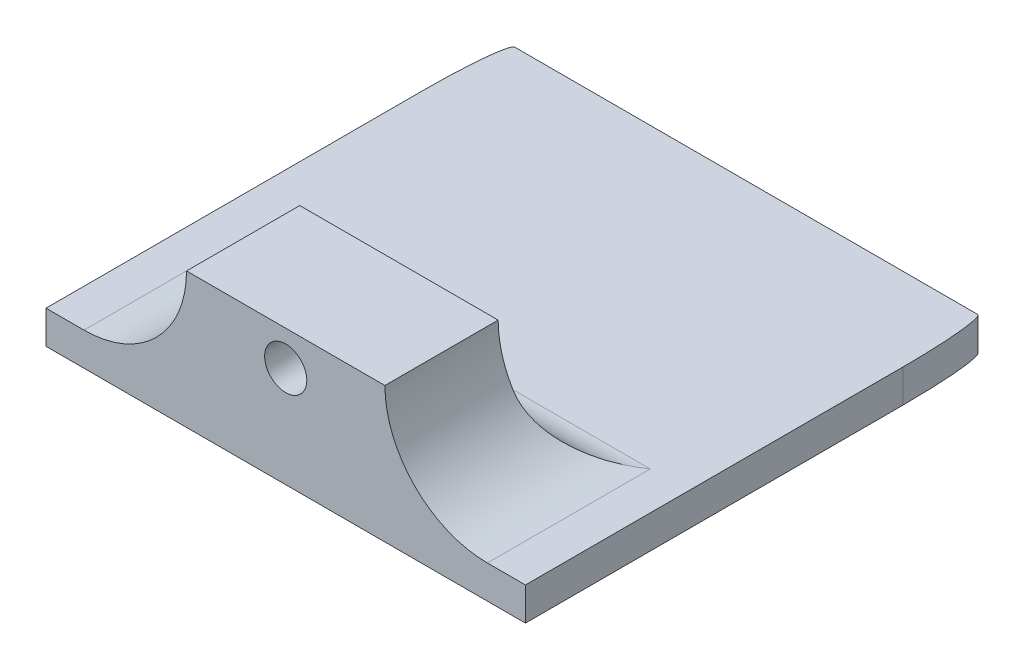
ISO-10303-21;
HEADER;
FILE_DESCRIPTION(('STEP AP214'),'2;1');
FILE_NAME('part.step','',(''),(''),'','','');
FILE_SCHEMA(('AUTOMOTIVE_DESIGN { 1 0 10303 214 1 1 1 1 }'));
ENDSEC;
DATA;
#1=APPLICATION_CONTEXT('core data for automotive mechanical design processes');
#2=APPLICATION_PROTOCOL_DEFINITION('international standard','automotive_design',2000,#1);
#3=PRODUCT_CONTEXT('',#1,'mechanical');
#4=PRODUCT('Part','Part','',(#3));
#5=PRODUCT_RELATED_PRODUCT_CATEGORY('part','',(#4));
#6=PRODUCT_DEFINITION_FORMATION('','',#4);
#7=PRODUCT_DEFINITION_CONTEXT('part definition',#1,'design');
#8=PRODUCT_DEFINITION('design','',#6,#7);
#9=PRODUCT_DEFINITION_SHAPE('','',#8);
#10=(LENGTH_UNIT() NAMED_UNIT(*) SI_UNIT(.MILLI.,.METRE.));
#11=(NAMED_UNIT(*) PLANE_ANGLE_UNIT() SI_UNIT($,.RADIAN.));
#12=(NAMED_UNIT(*) SI_UNIT($,.STERADIAN.) SOLID_ANGLE_UNIT());
#13=UNCERTAINTY_MEASURE_WITH_UNIT(LENGTH_MEASURE(1.E-05),#10,'distance_accuracy_value','');
#14=(GEOMETRIC_REPRESENTATION_CONTEXT(3) GLOBAL_UNCERTAINTY_ASSIGNED_CONTEXT((#13)) GLOBAL_UNIT_ASSIGNED_CONTEXT((#10,
#11,#12)) REPRESENTATION_CONTEXT('',''));
#15=CARTESIAN_POINT('',(0.,0.,0.));
#16=DIRECTION('',(0.,0.,1.));
#17=DIRECTION('',(1.,0.,0.));
#18=AXIS2_PLACEMENT_3D('',#15,#16,#17);
#19=CARTESIAN_POINT('',(0.,0.,-13.7));
#20=DIRECTION('',(0.,0.,1.));
#21=DIRECTION('',(1.,0.,0.));
#22=AXIS2_PLACEMENT_3D('',#19,#20,#21);
#23=PLANE('',#22);
#24=DIRECTION('',(1.,0.,0.));
#25=VECTOR('',#24,1.);
#26=CARTESIAN_POINT('',(-29.,-2.2,-13.7));
#27=LINE('',#26,#25);
#28=CARTESIAN_POINT('',(13.7792655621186,-2.2,-13.7));
#29=VERTEX_POINT('',#28);
#30=CARTESIAN_POINT('',(-13.7792655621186,-2.20000000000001,-13.7));
#31=VERTEX_POINT('',#30);
#32=EDGE_CURVE('E12',#29,#31,#27,.F.);
#33=ORIENTED_EDGE('',*,*,#32,.T.);
#34=CARTESIAN_POINT('',(-24.4,4.2,-13.7));
#35=DIRECTION('',(0.,0.,1.));
#36=DIRECTION('',(1.,0.,0.));
#37=AXIS2_PLACEMENT_3D('',#34,#35,#36);
#38=CIRCLE('',#37,12.4);
#39=CARTESIAN_POINT('',(-12.,4.2,-13.7));
#40=VERTEX_POINT('',#39);
#41=EDGE_CURVE('E126',#40,#31,#38,.F.);
#42=ORIENTED_EDGE('',*,*,#41,.F.);
#43=DIRECTION('',(1.,0.,0.));
#44=VECTOR('',#43,1.);
#45=CARTESIAN_POINT('',(29.,4.2,-13.7));
#46=LINE('',#45,#44);
#47=CARTESIAN_POINT('',(12.,4.2,-13.7));
#48=VERTEX_POINT('',#47);
#49=EDGE_CURVE('E139',#40,#48,#46,.T.);
#50=ORIENTED_EDGE('',*,*,#49,.T.);
#51=CARTESIAN_POINT('',(24.4,4.2,-13.7));
#52=DIRECTION('',(0.,0.,1.));
#53=DIRECTION('',(1.,0.,0.));
#54=AXIS2_PLACEMENT_3D('',#51,#52,#53);
#55=CIRCLE('',#54,12.4);
#56=EDGE_CURVE('E413',#29,#48,#55,.F.);
#57=ORIENTED_EDGE('',*,*,#56,.F.);
#58=EDGE_LOOP('',(#33,#42,#50,#57));
#59=FACE_BOUND('',#58,.T.);
#60=ADVANCED_FACE('F43',(#59),#23,.F.);
#61=CARTESIAN_POINT('',(-29.,-12.2,-12.2));
#62=DIRECTION('',(-1.,0.,0.));
#63=DIRECTION('',(0.,0.,1.));
#64=AXIS2_PLACEMENT_3D('',#61,#62,#63);
#65=PLANE('',#64);
#66=DIRECTION('',(0.,-1.,0.));
#67=VECTOR('',#66,1.);
#68=CARTESIAN_POINT('',(-29.,-12.2,0.));
#69=LINE('',#68,#67);
#70=CARTESIAN_POINT('',(-29.,-8.2,0.));
#71=VERTEX_POINT('',#70);
#72=CARTESIAN_POINT('',(-29.,-12.2,0.));
#73=VERTEX_POINT('',#72);
#74=EDGE_CURVE('E159',#71,#73,#69,.T.);
#75=ORIENTED_EDGE('',*,*,#74,.F.);
#76=DIRECTION('',(0.,0.,1.));
#77=VECTOR('',#76,1.);
#78=CARTESIAN_POINT('',(-29.,-8.2,-55.7));
#79=LINE('',#78,#77);
#80=CARTESIAN_POINT('',(-29.,-8.2,-45.7));
#81=VERTEX_POINT('',#80);
#82=EDGE_CURVE('E147',#81,#71,#79,.T.);
#83=ORIENTED_EDGE('',*,*,#82,.F.);
#84=CARTESIAN_POINT('',(-29.,-12.4,-45.7));
#85=CARTESIAN_POINT('',(-29.,-10.9333333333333,-45.7));
#86=CARTESIAN_POINT('',(-29.,-9.46666666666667,-45.7));
#87=CARTESIAN_POINT('',(-29.,-8.,-45.7));
#88=(BOUNDED_CURVE() B_SPLINE_CURVE(3,(#84,#85,#86,#87),.UNSPECIFIED.,.F.,
.F.) B_SPLINE_CURVE_WITH_KNOTS((4,4),(0.008,0.0124),
.UNSPECIFIED.) CURVE() GEOMETRIC_REPRESENTATION_ITEM() RATIONAL_B_SPLINE_CURVE((1.,1.,1.,1.)) REPRESENTATION_ITEM(''));
#89=CARTESIAN_POINT('',(-29.,-12.2,-45.7));
#90=VERTEX_POINT('',#89);
#91=EDGE_CURVE('E315',#81,#90,#88,.F.);
#92=ORIENTED_EDGE('',*,*,#91,.T.);
#93=DIRECTION('',(0.,0.,1.));
#94=VECTOR('',#93,1.);
#95=CARTESIAN_POINT('',(-29.,-12.2,-12.2));
#96=LINE('',#95,#94);
#97=EDGE_CURVE('E170',#90,#73,#96,.T.);
#98=ORIENTED_EDGE('',*,*,#97,.T.);
#99=EDGE_LOOP('',(#75,#83,#92,#98));
#100=FACE_BOUND('',#99,.T.);
#101=ADVANCED_FACE('F208',(#100),#65,.T.);
#102=CARTESIAN_POINT('',(-29.,4.2,-12.2));
#103=DIRECTION('',(0.,1.,0.));
#104=DIRECTION('',(0.,0.,1.));
#105=AXIS2_PLACEMENT_3D('',#102,#103,#104);
#106=PLANE('',#105);
#107=DIRECTION('',(0.,0.,1.));
#108=VECTOR('',#107,1.);
#109=CARTESIAN_POINT('',(-12.,4.2,-55.751));
#110=LINE('',#109,#108);
#111=CARTESIAN_POINT('',(-12.,4.2,0.));
#112=VERTEX_POINT('',#111);
#113=EDGE_CURVE('E123',#40,#112,#110,.T.);
#114=ORIENTED_EDGE('',*,*,#113,.T.);
#115=DIRECTION('',(-1.,0.,0.));
#116=VECTOR('',#115,1.);
#117=CARTESIAN_POINT('',(-29.,4.2,0.));
#118=LINE('',#117,#116);
#119=CARTESIAN_POINT('',(12.,4.2,0.));
#120=VERTEX_POINT('',#119);
#121=EDGE_CURVE('E168',#120,#112,#118,.T.);
#122=ORIENTED_EDGE('',*,*,#121,.F.);
#123=DIRECTION('',(0.,0.,1.));
#124=VECTOR('',#123,1.);
#125=CARTESIAN_POINT('',(12.,4.2,-55.751));
#126=LINE('',#125,#124);
#127=EDGE_CURVE('E145',#48,#120,#126,.T.);
#128=ORIENTED_EDGE('',*,*,#127,.F.);
#129=ORIENTED_EDGE('',*,*,#49,.F.);
#130=EDGE_LOOP('',(#114,#122,#128,#129));
#131=FACE_BOUND('',#130,.T.);
#132=ADVANCED_FACE('F144',(#131),#106,.T.);
#133=CARTESIAN_POINT('',(29.,-12.2,-12.2));
#134=DIRECTION('',(1.,0.,0.));
#135=DIRECTION('',(0.,0.,-1.));
#136=AXIS2_PLACEMENT_3D('',#133,#134,#135);
#137=PLANE('',#136);
#138=DIRECTION('',(0.,0.,1.));
#139=VECTOR('',#138,1.);
#140=CARTESIAN_POINT('',(29.,-8.2,-55.7));
#141=LINE('',#140,#139);
#142=CARTESIAN_POINT('',(29.,-8.2,-45.7));
#143=VERTEX_POINT('',#142);
#144=CARTESIAN_POINT('',(29.,-8.2,0.));
#145=VERTEX_POINT('',#144);
#146=EDGE_CURVE('E152',#143,#145,#141,.T.);
#147=ORIENTED_EDGE('',*,*,#146,.T.);
#148=DIRECTION('',(0.,1.,0.));
#149=VECTOR('',#148,1.);
#150=CARTESIAN_POINT('',(29.,-12.2,0.));
#151=LINE('',#150,#149);
#152=CARTESIAN_POINT('',(29.,-12.2,0.));
#153=VERTEX_POINT('',#152);
#154=EDGE_CURVE('E165',#153,#145,#151,.T.);
#155=ORIENTED_EDGE('',*,*,#154,.F.);
#156=DIRECTION('',(0.,0.,1.));
#157=VECTOR('',#156,1.);
#158=CARTESIAN_POINT('',(29.,-12.2,-12.2));
#159=LINE('',#158,#157);
#160=CARTESIAN_POINT('',(29.,-12.2,-45.7));
#161=VERTEX_POINT('',#160);
#162=EDGE_CURVE('E176',#161,#153,#159,.T.);
#163=ORIENTED_EDGE('',*,*,#162,.F.);
#164=CARTESIAN_POINT('',(29.,-8.,-45.7));
#165=CARTESIAN_POINT('',(29.,-9.46666666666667,-45.7));
#166=CARTESIAN_POINT('',(29.,-10.9333333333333,-45.7));
#167=CARTESIAN_POINT('',(29.,-12.4,-45.7));
#168=(BOUNDED_CURVE() B_SPLINE_CURVE(3,(#164,#165,#166,#167),.UNSPECIFIED.,.F.,
.F.) B_SPLINE_CURVE_WITH_KNOTS((4,4),(-0.0124,-0.008),
.UNSPECIFIED.) CURVE() GEOMETRIC_REPRESENTATION_ITEM() RATIONAL_B_SPLINE_CURVE((1.,1.,1.,1.)) REPRESENTATION_ITEM(''));
#169=EDGE_CURVE('E330',#161,#143,#168,.F.);
#170=ORIENTED_EDGE('',*,*,#169,.T.);
#171=EDGE_LOOP('',(#147,#155,#163,#170));
#172=FACE_BOUND('',#171,.T.);
#173=ADVANCED_FACE('F205',(#172),#137,.T.);
#174=CARTESIAN_POINT('',(-29.,-12.2,-12.2));
#175=DIRECTION('',(0.,-1.,0.));
#176=DIRECTION('',(0.,0.,-1.));
#177=AXIS2_PLACEMENT_3D('',#174,#175,#176);
#178=PLANE('',#177);
#179=ORIENTED_EDGE('',*,*,#97,.F.);
#180=CARTESIAN_POINT('',(-28.,-12.2,-55.7));
#181=CARTESIAN_POINT('',(-29.,-12.2,-55.7));
#182=CARTESIAN_POINT('',(-29.,-12.2,-45.7));
#183=(BOUNDED_CURVE() B_SPLINE_CURVE(2,(#180,#181,#182),.UNSPECIFIED.,.F.,
.F.) B_SPLINE_CURVE_WITH_KNOTS((3,3),(0.,1.),
.UNSPECIFIED.) CURVE() GEOMETRIC_REPRESENTATION_ITEM() RATIONAL_B_SPLINE_CURVE((1.,
0.707106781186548,1.)) REPRESENTATION_ITEM(''));
#184=CARTESIAN_POINT('',(-28.,-12.2,-55.7));
#185=VERTEX_POINT('',#184);
#186=EDGE_CURVE('E312',#90,#185,#183,.F.);
#187=ORIENTED_EDGE('',*,*,#186,.T.);
#188=DIRECTION('',(-1.,0.,0.));
#189=VECTOR('',#188,1.);
#190=CARTESIAN_POINT('',(29.,-12.2,-55.7));
#191=LINE('',#190,#189);
#192=CARTESIAN_POINT('',(28.,-12.2,-55.7));
#193=VERTEX_POINT('',#192);
#194=EDGE_CURVE('E339',#193,#185,#191,.T.);
#195=ORIENTED_EDGE('',*,*,#194,.F.);
#196=CARTESIAN_POINT('',(29.,-12.2,-45.7));
#197=CARTESIAN_POINT('',(29.,-12.2,-55.7));
#198=CARTESIAN_POINT('',(28.,-12.2,-55.7));
#199=(BOUNDED_CURVE() B_SPLINE_CURVE(2,(#196,#197,#198),.UNSPECIFIED.,.F.,
.F.) B_SPLINE_CURVE_WITH_KNOTS((3,3),(0.,1.),
.UNSPECIFIED.) CURVE() GEOMETRIC_REPRESENTATION_ITEM() RATIONAL_B_SPLINE_CURVE((1.,
0.707106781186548,1.)) REPRESENTATION_ITEM(''));
#200=EDGE_CURVE('E187',#193,#161,#199,.F.);
#201=ORIENTED_EDGE('',*,*,#200,.T.);
#202=ORIENTED_EDGE('',*,*,#162,.T.);
#203=DIRECTION('',(1.,0.,0.));
#204=VECTOR('',#203,1.);
#205=CARTESIAN_POINT('',(-29.,-12.2,0.));
#206=LINE('',#205,#204);
#207=EDGE_CURVE('E162',#73,#153,#206,.T.);
#208=ORIENTED_EDGE('',*,*,#207,.F.);
#209=EDGE_LOOP('',(#179,#187,#195,#201,#202,#208));
#210=FACE_BOUND('',#209,.T.);
#211=ADVANCED_FACE('F194',(#210),#178,.T.);
#212=CARTESIAN_POINT('',(0.,0.,0.));
#213=DIRECTION('',(0.,0.,-1.));
#214=DIRECTION('',(-1.,0.,0.));
#215=AXIS2_PLACEMENT_3D('',#212,#213,#214);
#216=PLANE('',#215);
#217=CARTESIAN_POINT('',(0.,0.,0.));
#218=DIRECTION('',(0.,0.,1.));
#219=DIRECTION('',(1.,0.,0.));
#220=AXIS2_PLACEMENT_3D('',#217,#218,#219);
#221=CIRCLE('',#220,2.55);
#222=CARTESIAN_POINT('',(2.55,0.,0.));
#223=VERTEX_POINT('',#222);
#224=EDGE_CURVE('E146',#223,#223,#221,.T.);
#225=ORIENTED_EDGE('',*,*,#224,.F.);
#226=EDGE_LOOP('',(#225));
#227=FACE_BOUND('',#226,.T.);
#228=ORIENTED_EDGE('',*,*,#121,.T.);
#229=CARTESIAN_POINT('',(-24.4,4.2,0.));
#230=DIRECTION('',(0.,0.,1.));
#231=DIRECTION('',(-1.,0.,0.));
#232=AXIS2_PLACEMENT_3D('',#229,#230,#231);
#233=CIRCLE('',#232,12.4);
#234=CARTESIAN_POINT('',(-24.4,-8.2,0.));
#235=VERTEX_POINT('',#234);
#236=EDGE_CURVE('E128',#235,#112,#233,.T.);
#237=ORIENTED_EDGE('',*,*,#236,.F.);
#238=DIRECTION('',(1.,0.,0.));
#239=VECTOR('',#238,1.);
#240=CARTESIAN_POINT('',(-24.4,-8.2,0.));
#241=LINE('',#240,#239);
#242=EDGE_CURVE('E134',#71,#235,#241,.T.);
#243=ORIENTED_EDGE('',*,*,#242,.F.);
#244=ORIENTED_EDGE('',*,*,#74,.T.);
#245=ORIENTED_EDGE('',*,*,#207,.T.);
#246=ORIENTED_EDGE('',*,*,#154,.T.);
#247=DIRECTION('',(1.,0.,0.));
#248=VECTOR('',#247,1.);
#249=CARTESIAN_POINT('',(24.4,-8.2,0.));
#250=LINE('',#249,#248);
#251=CARTESIAN_POINT('',(24.4,-8.2,0.));
#252=VERTEX_POINT('',#251);
#253=EDGE_CURVE('E417',#252,#145,#250,.T.);
#254=ORIENTED_EDGE('',*,*,#253,.F.);
#255=CARTESIAN_POINT('',(24.4,4.2,0.));
#256=DIRECTION('',(0.,0.,1.));
#257=DIRECTION('',(1.,0.,0.));
#258=AXIS2_PLACEMENT_3D('',#255,#256,#257);
#259=CIRCLE('',#258,12.4);
#260=EDGE_CURVE('E415',#120,#252,#259,.T.);
#261=ORIENTED_EDGE('',*,*,#260,.F.);
#262=EDGE_LOOP('',(#228,#237,#243,#244,#245,#246,#254,#261));
#263=FACE_BOUND('',#262,.T.);
#264=ADVANCED_FACE('F204',(#227,#263),#216,.F.);
#265=CARTESIAN_POINT('',(0.,0.,-12.2));
#266=DIRECTION('',(0.,0.,1.));
#267=DIRECTION('',(1.,0.,0.));
#268=AXIS2_PLACEMENT_3D('',#265,#266,#267);
#269=CYLINDRICAL_SURFACE('',#268,2.55);
#270=CARTESIAN_POINT('',(0.,0.,-12.2));
#271=DIRECTION('',(0.,0.,1.));
#272=DIRECTION('',(1.,0.,0.));
#273=AXIS2_PLACEMENT_3D('',#270,#271,#272);
#274=CIRCLE('',#273,2.55);
#275=CARTESIAN_POINT('',(2.55,0.,-12.2));
#276=VERTEX_POINT('',#275);
#277=EDGE_CURVE('E150',#276,#276,#274,.T.);
#278=ORIENTED_EDGE('',*,*,#277,.F.);
#279=EDGE_LOOP('',(#278));
#280=FACE_BOUND('',#279,.T.);
#281=ORIENTED_EDGE('',*,*,#224,.T.);
#282=EDGE_LOOP('',(#281));
#283=FACE_BOUND('',#282,.T.);
#284=ADVANCED_FACE('F462',(#280,#283),#269,.F.);
#285=CARTESIAN_POINT('',(0.,0.,-12.2));
#286=DIRECTION('',(0.,0.,1.));
#287=DIRECTION('',(1.,0.,0.));
#288=AXIS2_PLACEMENT_3D('',#285,#286,#287);
#289=PLANE('',#288);
#290=ORIENTED_EDGE('',*,*,#277,.T.);
#291=EDGE_LOOP('',(#290));
#292=FACE_BOUND('',#291,.T.);
#293=ADVANCED_FACE('F379',(#292),#289,.T.);
#294=CARTESIAN_POINT('',(29.,-8.2,-55.7));
#295=DIRECTION('',(0.,-1.,0.));
#296=DIRECTION('',(0.,0.,-1.));
#297=AXIS2_PLACEMENT_3D('',#294,#295,#296);
#298=PLANE('',#297);
#299=ORIENTED_EDGE('',*,*,#82,.T.);
#300=ORIENTED_EDGE('',*,*,#242,.T.);
#301=DIRECTION('',(0.,0.,1.));
#302=VECTOR('',#301,1.);
#303=CARTESIAN_POINT('',(-24.4,-8.2,-55.751));
#304=LINE('',#303,#302);
#305=CARTESIAN_POINT('',(-24.4,-8.2,-19.7));
#306=VERTEX_POINT('',#305);
#307=EDGE_CURVE('E133',#306,#235,#304,.T.);
#308=ORIENTED_EDGE('',*,*,#307,.F.);
#309=DIRECTION('',(1.,0.,0.));
#310=VECTOR('',#309,1.);
#311=CARTESIAN_POINT('',(29.,-8.2,-19.7));
#312=LINE('',#311,#310);
#313=CARTESIAN_POINT('',(24.4,-8.2,-19.7));
#314=VERTEX_POINT('',#313);
#315=EDGE_CURVE('E50',#306,#314,#312,.T.);
#316=ORIENTED_EDGE('',*,*,#315,.T.);
#317=DIRECTION('',(0.,0.,1.));
#318=VECTOR('',#317,1.);
#319=CARTESIAN_POINT('',(24.4,-8.2,-55.751));
#320=LINE('',#319,#318);
#321=EDGE_CURVE('E57',#314,#252,#320,.T.);
#322=ORIENTED_EDGE('',*,*,#321,.T.);
#323=ORIENTED_EDGE('',*,*,#253,.T.);
#324=ORIENTED_EDGE('',*,*,#146,.F.);
#325=CARTESIAN_POINT('',(28.,-8.2,-55.7));
#326=CARTESIAN_POINT('',(29.,-8.2,-55.7));
#327=CARTESIAN_POINT('',(29.,-8.2,-45.7));
#328=(BOUNDED_CURVE() B_SPLINE_CURVE(2,(#325,#326,#327),.UNSPECIFIED.,.F.,
.F.) B_SPLINE_CURVE_WITH_KNOTS((3,3),(0.,1.),
.UNSPECIFIED.) CURVE() GEOMETRIC_REPRESENTATION_ITEM() RATIONAL_B_SPLINE_CURVE((1.,
0.707106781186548,1.)) REPRESENTATION_ITEM(''));
#329=CARTESIAN_POINT('',(28.,-8.2,-55.7));
#330=VERTEX_POINT('',#329);
#331=EDGE_CURVE('E326',#143,#330,#328,.F.);
#332=ORIENTED_EDGE('',*,*,#331,.T.);
#333=DIRECTION('',(1.,0.,0.));
#334=VECTOR('',#333,1.);
#335=CARTESIAN_POINT('',(29.,-8.2,-55.7));
#336=LINE('',#335,#334);
#337=CARTESIAN_POINT('',(-28.,-8.2,-55.7));
#338=VERTEX_POINT('',#337);
#339=EDGE_CURVE('E340',#338,#330,#336,.T.);
#340=ORIENTED_EDGE('',*,*,#339,.F.);
#341=CARTESIAN_POINT('',(-29.,-8.2,-45.7));
#342=CARTESIAN_POINT('',(-29.,-8.2,-55.7));
#343=CARTESIAN_POINT('',(-28.,-8.2,-55.7));
#344=(BOUNDED_CURVE() B_SPLINE_CURVE(2,(#341,#342,#343),.UNSPECIFIED.,.F.,
.F.) B_SPLINE_CURVE_WITH_KNOTS((3,3),(0.,1.),
.UNSPECIFIED.) CURVE() GEOMETRIC_REPRESENTATION_ITEM() RATIONAL_B_SPLINE_CURVE((1.,
0.707106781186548,1.)) REPRESENTATION_ITEM(''));
#345=EDGE_CURVE('E227',#338,#81,#344,.F.);
#346=ORIENTED_EDGE('',*,*,#345,.T.);
#347=EDGE_LOOP('',(#299,#300,#308,#316,#322,#323,#324,#332,#340,#346));
#348=FACE_BOUND('',#347,.T.);
#349=ADVANCED_FACE('F372',(#348),#298,.F.);
#350=CARTESIAN_POINT('',(0.,0.,-55.7));
#351=DIRECTION('',(0.,0.,1.));
#352=DIRECTION('',(1.,0.,0.));
#353=AXIS2_PLACEMENT_3D('',#350,#351,#352);
#354=PLANE('',#353);
#355=ORIENTED_EDGE('',*,*,#194,.T.);
#356=CARTESIAN_POINT('',(-28.,-8.,-55.7));
#357=CARTESIAN_POINT('',(-28.,-9.46666666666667,-55.7));
#358=CARTESIAN_POINT('',(-28.,-10.9333333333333,-55.7));
#359=CARTESIAN_POINT('',(-28.,-12.4,-55.7));
#360=(BOUNDED_CURVE() B_SPLINE_CURVE(3,(#356,#357,#358,#359),.UNSPECIFIED.,.F.,
.F.) B_SPLINE_CURVE_WITH_KNOTS((4,4),(0.008,0.0124),
.UNSPECIFIED.) CURVE() GEOMETRIC_REPRESENTATION_ITEM() RATIONAL_B_SPLINE_CURVE((1.,1.,1.,1.)) REPRESENTATION_ITEM(''));
#361=EDGE_CURVE('E323',#185,#338,#360,.F.);
#362=ORIENTED_EDGE('',*,*,#361,.T.);
#363=ORIENTED_EDGE('',*,*,#339,.T.);
#364=CARTESIAN_POINT('',(28.,-12.4,-55.7));
#365=CARTESIAN_POINT('',(28.,-10.9333333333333,-55.7));
#366=CARTESIAN_POINT('',(28.,-9.46666666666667,-55.7));
#367=CARTESIAN_POINT('',(28.,-8.,-55.7));
#368=(BOUNDED_CURVE() B_SPLINE_CURVE(3,(#364,#365,#366,#367),.UNSPECIFIED.,.F.,
.F.) B_SPLINE_CURVE_WITH_KNOTS((4,4),(-0.0124,-0.008),
.UNSPECIFIED.) CURVE() GEOMETRIC_REPRESENTATION_ITEM() RATIONAL_B_SPLINE_CURVE((1.,1.,1.,1.)) REPRESENTATION_ITEM(''));
#369=EDGE_CURVE('E179',#330,#193,#368,.F.);
#370=ORIENTED_EDGE('',*,*,#369,.T.);
#371=EDGE_LOOP('',(#355,#362,#363,#370));
#372=FACE_BOUND('',#371,.T.);
#373=ADVANCED_FACE('F338',(#372),#354,.F.);
#374=CARTESIAN_POINT('',(29.,-12.4,-45.7));
#375=CARTESIAN_POINT('',(29.,-10.9333333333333,-45.7));
#376=CARTESIAN_POINT('',(29.,-9.46666666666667,-45.7));
#377=CARTESIAN_POINT('',(29.,-8.,-45.7));
#378=CARTESIAN_POINT('',(29.,-12.4,-55.7));
#379=CARTESIAN_POINT('',(29.,-10.9333333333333,-55.7));
#380=CARTESIAN_POINT('',(29.,-9.46666666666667,-55.7));
#381=CARTESIAN_POINT('',(29.,-8.,-55.7));
#382=CARTESIAN_POINT('',(28.,-12.4,-55.7));
#383=CARTESIAN_POINT('',(28.,-10.9333333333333,-55.7));
#384=CARTESIAN_POINT('',(28.,-9.46666666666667,-55.7));
#385=CARTESIAN_POINT('',(28.,-8.,-55.7));
#386=(BOUNDED_SURFACE() B_SPLINE_SURFACE(2,3,((#374,#375,#376,#377),(#378,#379,#380,#381),(#382,
#383,#384,#385)),.UNSPECIFIED.,.F.,.F.,.F.) B_SPLINE_SURFACE_WITH_KNOTS((3,3),(4,4),(0.,1.),
(-0.0124,-0.008),.UNSPECIFIED.) GEOMETRIC_REPRESENTATION_ITEM() RATIONAL_B_SPLINE_SURFACE(((1.,
1.,1.,1.),(0.707106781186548,0.707106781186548,0.707106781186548,0.707106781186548),(1.,1.,1.,1.))) REPRESENTATION_ITEM('') SURFACE());
#387=ORIENTED_EDGE('',*,*,#331,.F.);
#388=ORIENTED_EDGE('',*,*,#169,.F.);
#389=ORIENTED_EDGE('',*,*,#200,.F.);
#390=ORIENTED_EDGE('',*,*,#369,.F.);
#391=EDGE_LOOP('',(#387,#388,#389,#390));
#392=FACE_BOUND('',#391,.T.);
#393=ADVANCED_FACE('F247',(#392),#386,.T.);
#394=CARTESIAN_POINT('',(-29.,-8.,-45.7));
#395=CARTESIAN_POINT('',(-29.,-9.46666666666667,-45.7));
#396=CARTESIAN_POINT('',(-29.,-10.9333333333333,-45.7));
#397=CARTESIAN_POINT('',(-29.,-12.4,-45.7));
#398=CARTESIAN_POINT('',(-29.,-8.,-55.7));
#399=CARTESIAN_POINT('',(-29.,-9.46666666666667,-55.7));
#400=CARTESIAN_POINT('',(-29.,-10.9333333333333,-55.7));
#401=CARTESIAN_POINT('',(-29.,-12.4,-55.7));
#402=CARTESIAN_POINT('',(-28.,-8.,-55.7));
#403=CARTESIAN_POINT('',(-28.,-9.46666666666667,-55.7));
#404=CARTESIAN_POINT('',(-28.,-10.9333333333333,-55.7));
#405=CARTESIAN_POINT('',(-28.,-12.4,-55.7));
#406=(BOUNDED_SURFACE() B_SPLINE_SURFACE(2,3,((#394,#395,#396,#397),(#398,#399,#400,#401),(#402,
#403,#404,#405)),.UNSPECIFIED.,.F.,.F.,.F.) B_SPLINE_SURFACE_WITH_KNOTS((3,3),(4,4),(0.,1.),
(0.008,0.0124),.UNSPECIFIED.) GEOMETRIC_REPRESENTATION_ITEM() RATIONAL_B_SPLINE_SURFACE(((1.,1.,
1.,1.),(0.707106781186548,0.707106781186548,0.707106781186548,0.707106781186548),(1.,1.,1.,1.))) REPRESENTATION_ITEM('') SURFACE());
#407=ORIENTED_EDGE('',*,*,#186,.F.);
#408=ORIENTED_EDGE('',*,*,#91,.F.);
#409=ORIENTED_EDGE('',*,*,#345,.F.);
#410=ORIENTED_EDGE('',*,*,#361,.F.);
#411=EDGE_LOOP('',(#407,#408,#409,#410));
#412=FACE_BOUND('',#411,.T.);
#413=ADVANCED_FACE('F234',(#412),#406,.T.);
#414=CARTESIAN_POINT('',(29.,-2.2,-19.7));
#415=DIRECTION('',(-1.,0.,0.));
#416=DIRECTION('',(0.,0.,1.));
#417=AXIS2_PLACEMENT_3D('',#414,#415,#416);
#418=CYLINDRICAL_SURFACE('',#417,6.);
#419=ORIENTED_EDGE('',*,*,#315,.F.);
#420=CARTESIAN_POINT('',(-13.7792655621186,-2.2,-13.7));
#421=CARTESIAN_POINT('',(-13.8460787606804,-2.31088250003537,-13.7000005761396));
#422=CARTESIAN_POINT('',(-13.9146153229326,-2.42068254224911,-13.7030737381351));
#423=CARTESIAN_POINT('',(-14.054916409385,-2.63783118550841,-13.7150082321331));
#424=CARTESIAN_POINT('',(-14.1266798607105,-2.74518058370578,-13.72386765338));
#425=CARTESIAN_POINT('',(-14.3461697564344,-3.0626812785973,-13.7585332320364));
#426=CARTESIAN_POINT('',(-14.4984448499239,-3.26886356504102,-13.79243047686));
#427=CARTESIAN_POINT('',(-14.8112977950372,-3.66638591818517,-13.8784384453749));
#428=CARTESIAN_POINT('',(-14.9717467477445,-3.85788034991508,-13.9303141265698));
#429=CARTESIAN_POINT('',(-15.3013075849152,-4.22824364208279,-14.0498570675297));
#430=CARTESIAN_POINT('',(-15.4704255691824,-4.40710339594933,-14.1175355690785));
#431=CARTESIAN_POINT('',(-15.8541683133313,-4.78985941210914,-14.2828789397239));
#432=CARTESIAN_POINT('',(-16.0705769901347,-4.99052871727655,-14.3838653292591));
#433=CARTESIAN_POINT('',(-16.5121122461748,-5.37216915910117,-14.6023825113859));
#434=CARTESIAN_POINT('',(-16.73723932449,-5.55313916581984,-14.7199142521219));
#435=CARTESIAN_POINT('',(-17.19586528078,-5.89668259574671,-14.9692662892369));
#436=CARTESIAN_POINT('',(-17.4294046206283,-6.05914507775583,-15.1011643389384));
#437=CARTESIAN_POINT('',(-17.9022508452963,-6.36496824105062,-15.3761900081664));
#438=CARTESIAN_POINT('',(-18.1415581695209,-6.50832746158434,-15.519318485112));
#439=CARTESIAN_POINT('',(-18.7231176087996,-6.83105313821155,-15.8748043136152));
#440=CARTESIAN_POINT('',(-19.0676705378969,-7.00136528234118,-16.0916510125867));
#441=CARTESIAN_POINT('',(-19.7636063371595,-7.30688342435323,-16.538813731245));
#442=CARTESIAN_POINT('',(-20.1149922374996,-7.44207344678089,-16.769135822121));
#443=CARTESIAN_POINT('',(-20.8220164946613,-7.67841482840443,-17.2390990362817));
#444=CARTESIAN_POINT('',(-21.177647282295,-7.77961946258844,-17.4787249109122));
#445=CARTESIAN_POINT('',(-21.8920079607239,-7.94926673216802,-17.9644660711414));
#446=CARTESIAN_POINT('',(-22.2507364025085,-8.01772392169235,-18.2105784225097));
#447=CARTESIAN_POINT('',(-22.9049123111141,-8.11313500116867,-18.6617626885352));
#448=CARTESIAN_POINT('',(-23.2000526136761,-8.14536044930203,-18.8661937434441));
#449=CARTESIAN_POINT('',(-23.7907238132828,-8.1885577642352,-19.2761909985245));
#450=CARTESIAN_POINT('',(-24.0862540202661,-8.19955094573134,-19.4817558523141));
#451=CARTESIAN_POINT('',(-24.3878114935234,-8.19999550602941,-19.6915215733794));
#452=CARTESIAN_POINT('',(-24.3939057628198,-8.19999999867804,-19.6957607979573));
#453=CARTESIAN_POINT('',(-24.4,-8.2,-19.7));
#454=B_SPLINE_CURVE_WITH_KNOTS('',3,(#420,#421,#422,#423,#424,#425,#426,#427,#428,#429,#430,
#431,#432,#433,#434,#435,#436,#437,#438,#439,#440,#441,#442,#443,#444,#445,#446,#447,#448,#449,
#450,#451,#452,#453),.UNSPECIFIED.,.F.,.F.,(4,2,2,2,2,2,2,2,2,2,2,2,2,2,2,2,4),(0.,
0.388250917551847,0.776373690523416,1.55060265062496,2.31506937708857,3.08008159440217,
4.01450564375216,4.94898326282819,5.88879658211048,6.82868172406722,8.15065646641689,
9.47323146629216,10.7937234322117,12.1136279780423,13.194457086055,14.2742006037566,
14.2964716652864),.UNSPECIFIED.);
#455=EDGE_CURVE('E65',#31,#306,#454,.T.);
#456=ORIENTED_EDGE('',*,*,#455,.F.);
#457=ORIENTED_EDGE('',*,*,#32,.F.);
#458=CARTESIAN_POINT('',(13.7792655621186,-2.2,-13.7));
#459=CARTESIAN_POINT('',(13.8460787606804,-2.31088250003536,-13.7000005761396));
#460=CARTESIAN_POINT('',(13.9146153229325,-2.42068254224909,-13.7030737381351));
#461=CARTESIAN_POINT('',(14.054916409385,-2.63783118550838,-13.7150082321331));
#462=CARTESIAN_POINT('',(14.1266798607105,-2.74518058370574,-13.72386765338));
#463=CARTESIAN_POINT('',(14.3461697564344,-3.06268127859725,-13.7585332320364));
#464=CARTESIAN_POINT('',(14.4984448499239,-3.26886356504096,-13.79243047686));
#465=CARTESIAN_POINT('',(14.8112977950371,-3.66638591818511,-13.8784384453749));
#466=CARTESIAN_POINT('',(14.9717467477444,-3.85788034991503,-13.9303141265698));
#467=CARTESIAN_POINT('',(15.3013075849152,-4.22824364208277,-14.0498570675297));
#468=CARTESIAN_POINT('',(15.4704255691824,-4.40710339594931,-14.1175355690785));
#469=CARTESIAN_POINT('',(15.8541683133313,-4.78985941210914,-14.2828789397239));
#470=CARTESIAN_POINT('',(16.0705769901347,-4.99052871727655,-14.3838653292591));
#471=CARTESIAN_POINT('',(16.5121122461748,-5.37216915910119,-14.6023825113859));
#472=CARTESIAN_POINT('',(16.7372393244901,-5.55313916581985,-14.7199142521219));
#473=CARTESIAN_POINT('',(17.19586528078,-5.89668259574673,-14.9692662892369));
#474=CARTESIAN_POINT('',(17.4294046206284,-6.05914507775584,-15.1011643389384));
#475=CARTESIAN_POINT('',(17.9022508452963,-6.36496824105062,-15.3761900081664));
#476=CARTESIAN_POINT('',(18.1415581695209,-6.50832746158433,-15.519318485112));
#477=CARTESIAN_POINT('',(18.7231176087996,-6.83105313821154,-15.8748043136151));
#478=CARTESIAN_POINT('',(19.0676705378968,-7.00136528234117,-16.0916510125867));
#479=CARTESIAN_POINT('',(19.7636063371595,-7.30688342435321,-16.538813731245));
#480=CARTESIAN_POINT('',(20.1149922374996,-7.44207344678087,-16.769135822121));
#481=CARTESIAN_POINT('',(20.8220164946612,-7.67841482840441,-17.2390990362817));
#482=CARTESIAN_POINT('',(21.1776472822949,-7.77961946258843,-17.4787249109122));
#483=CARTESIAN_POINT('',(21.8920079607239,-7.94926673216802,-17.9644660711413));
#484=CARTESIAN_POINT('',(22.2507364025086,-8.01772392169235,-18.2105784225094));
#485=CARTESIAN_POINT('',(22.904912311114,-8.11313500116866,-18.6617626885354));
#486=CARTESIAN_POINT('',(23.2000526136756,-8.14536044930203,-18.8661937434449));
#487=CARTESIAN_POINT('',(23.7907238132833,-8.1885577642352,-19.2761909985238));
#488=CARTESIAN_POINT('',(24.086254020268,-8.19955094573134,-19.4817558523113));
#489=CARTESIAN_POINT('',(24.3878114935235,-8.19999550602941,-19.6915215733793));
#490=CARTESIAN_POINT('',(24.3939057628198,-8.19999999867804,-19.6957607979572));
#491=CARTESIAN_POINT('',(24.4,-8.2,-19.7));
#492=B_SPLINE_CURVE_WITH_KNOTS('',3,(#458,#459,#460,#461,#462,#463,#464,#465,#466,#467,#468,
#469,#470,#471,#472,#473,#474,#475,#476,#477,#478,#479,#480,#481,#482,#483,#484,#485,#486,#487,
#488,#489,#490,#491),.UNSPECIFIED.,.F.,.F.,(4,2,2,2,2,2,2,2,2,2,2,2,2,2,2,2,4),(0.,
0.388250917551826,0.776373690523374,1.55060265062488,2.31506937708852,3.08008159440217,
4.01450564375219,4.94898326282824,5.8887965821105,6.82868172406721,8.15065646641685,
9.47323146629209,10.7937234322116,12.1136279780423,13.194457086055,14.2742006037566,
14.2964716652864),.UNSPECIFIED.);
#493=EDGE_CURVE('E141',#314,#29,#492,.F.);
#494=ORIENTED_EDGE('',*,*,#493,.F.);
#495=EDGE_LOOP('',(#419,#456,#457,#494));
#496=FACE_BOUND('',#495,.T.);
#497=ADVANCED_FACE('F45',(#496),#418,.F.);
#498=CARTESIAN_POINT('',(24.4,4.2,-55.751));
#499=DIRECTION('',(0.,0.,1.));
#500=DIRECTION('',(1.,0.,0.));
#501=AXIS2_PLACEMENT_3D('',#498,#499,#500);
#502=CYLINDRICAL_SURFACE('',#501,12.4);
#503=ORIENTED_EDGE('',*,*,#56,.T.);
#504=ORIENTED_EDGE('',*,*,#127,.T.);
#505=ORIENTED_EDGE('',*,*,#260,.T.);
#506=ORIENTED_EDGE('',*,*,#321,.F.);
#507=ORIENTED_EDGE('',*,*,#493,.T.);
#508=EDGE_LOOP('',(#503,#504,#505,#506,#507));
#509=FACE_BOUND('',#508,.T.);
#510=ADVANCED_FACE('F373',(#509),#502,.F.);
#511=CARTESIAN_POINT('',(-24.4,4.2,-55.751));
#512=DIRECTION('',(0.,0.,1.));
#513=DIRECTION('',(1.,0.,0.));
#514=AXIS2_PLACEMENT_3D('',#511,#512,#513);
#515=CYLINDRICAL_SURFACE('',#514,12.4);
#516=ORIENTED_EDGE('',*,*,#41,.T.);
#517=ORIENTED_EDGE('',*,*,#455,.T.);
#518=ORIENTED_EDGE('',*,*,#307,.T.);
#519=ORIENTED_EDGE('',*,*,#236,.T.);
#520=ORIENTED_EDGE('',*,*,#113,.F.);
#521=EDGE_LOOP('',(#516,#517,#518,#519,#520));
#522=FACE_BOUND('',#521,.T.);
#523=ADVANCED_FACE('F125',(#522),#515,.F.);
#524=CLOSED_SHELL('',(#60,#101,#132,#173,#211,#264,#284,#293,#349,#373,#393,#413,#497,#510,#523));
#525=MANIFOLD_SOLID_BREP('B2',#524);
#526=ADVANCED_BREP_SHAPE_REPRESENTATION('',(#18,#525),#14);
#527=SHAPE_DEFINITION_REPRESENTATION(#9,#526);
ENDSEC;
END-ISO-10303-21;
